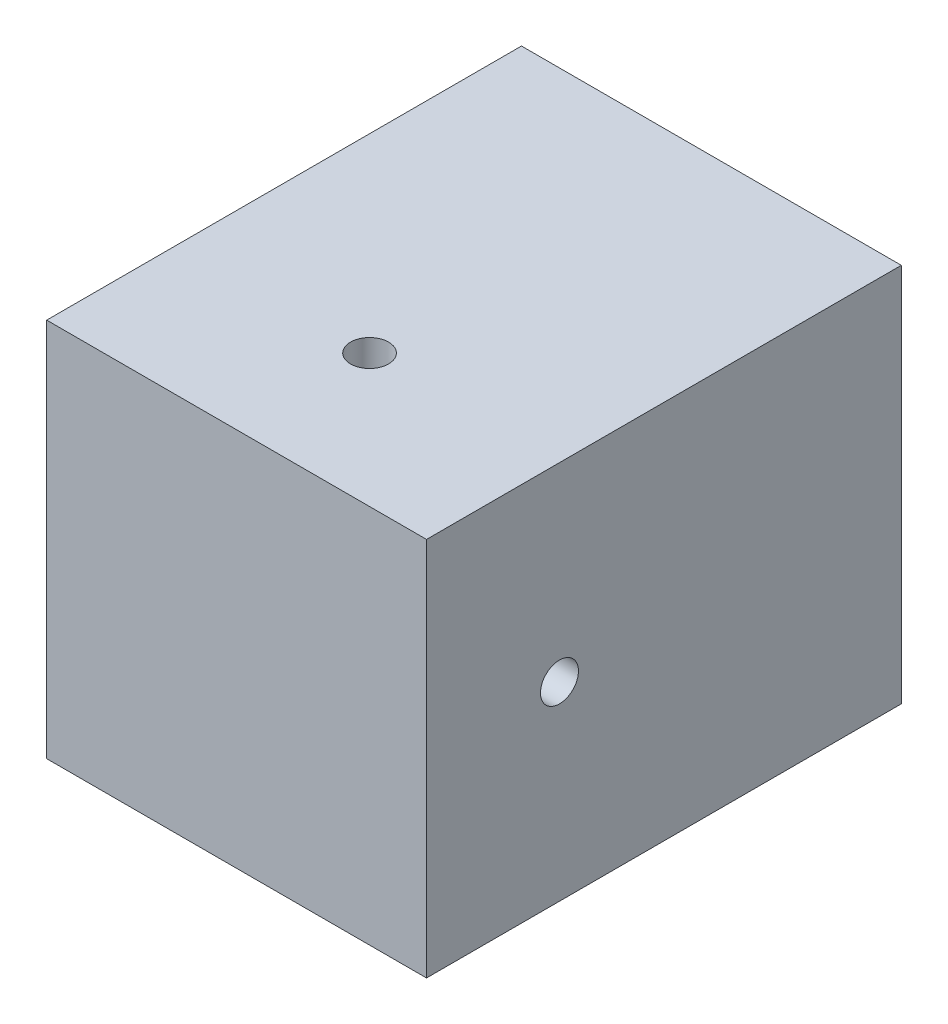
ISO-10303-21;
HEADER;
FILE_DESCRIPTION(('STEP AP214'),'2;1');
FILE_NAME('part.step','',(''),(''),'','','');
FILE_SCHEMA(('AUTOMOTIVE_DESIGN { 1 0 10303 214 1 1 1 1 }'));
ENDSEC;
DATA;
#1=APPLICATION_CONTEXT('core data for automotive mechanical design processes');
#2=APPLICATION_PROTOCOL_DEFINITION('international standard','automotive_design',2000,#1);
#3=PRODUCT_CONTEXT('',#1,'mechanical');
#4=PRODUCT('Part','Part','',(#3));
#5=PRODUCT_RELATED_PRODUCT_CATEGORY('part','',(#4));
#6=PRODUCT_DEFINITION_FORMATION('','',#4);
#7=PRODUCT_DEFINITION_CONTEXT('part definition',#1,'design');
#8=PRODUCT_DEFINITION('design','',#6,#7);
#9=PRODUCT_DEFINITION_SHAPE('','',#8);
#10=(LENGTH_UNIT() NAMED_UNIT(*) SI_UNIT(.MILLI.,.METRE.));
#11=(NAMED_UNIT(*) PLANE_ANGLE_UNIT() SI_UNIT($,.RADIAN.));
#12=(NAMED_UNIT(*) SI_UNIT($,.STERADIAN.) SOLID_ANGLE_UNIT());
#13=UNCERTAINTY_MEASURE_WITH_UNIT(LENGTH_MEASURE(1.E-05),#10,'distance_accuracy_value','');
#14=(GEOMETRIC_REPRESENTATION_CONTEXT(3) GLOBAL_UNCERTAINTY_ASSIGNED_CONTEXT((#13)) GLOBAL_UNIT_ASSIGNED_CONTEXT((#10,
#11,#12)) REPRESENTATION_CONTEXT('',''));
#15=CARTESIAN_POINT('',(0.,0.,0.));
#16=DIRECTION('',(0.,0.,1.));
#17=DIRECTION('',(1.,0.,0.));
#18=AXIS2_PLACEMENT_3D('',#15,#16,#17);
#19=CARTESIAN_POINT('',(-15.,0.,18.));
#20=DIRECTION('',(1.,0.,0.));
#21=DIRECTION('',(0.,1.,0.));
#22=AXIS2_PLACEMENT_3D('',#19,#20,#21);
#23=CYLINDRICAL_SURFACE('',#22,1.);
#24=CARTESIAN_POINT('',(10.,0.,18.));
#25=DIRECTION('',(1.,0.,0.));
#26=DIRECTION('',(0.,1.,0.));
#27=AXIS2_PLACEMENT_3D('',#24,#25,#26);
#28=CIRCLE('',#27,1.);
#29=CARTESIAN_POINT('',(10.,1.,18.));
#30=VERTEX_POINT('',#29);
#31=EDGE_CURVE('E107',#30,#30,#28,.T.);
#32=ORIENTED_EDGE('',*,*,#31,.T.);
#33=EDGE_LOOP('',(#32));
#34=FACE_BOUND('',#33,.T.);
#35=CARTESIAN_POINT('',(0.,0.,18.));
#36=DIRECTION('',(0.707106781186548,-0.707106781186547,0.));
#37=DIRECTION('',(0.707106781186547,0.707106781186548,0.));
#38=AXIS2_PLACEMENT_3D('',#35,#36,#37);
#39=ELLIPSE('',#38,1.4142135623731,1.);
#40=CARTESIAN_POINT('',(0.,0.,19.));
#41=VERTEX_POINT('',#40);
#42=CARTESIAN_POINT('',(0.,0.,17.));
#43=VERTEX_POINT('',#42);
#44=EDGE_CURVE('E46',#41,#43,#39,.F.);
#45=ORIENTED_EDGE('',*,*,#44,.T.);
#46=CARTESIAN_POINT('',(0.,0.,18.));
#47=DIRECTION('',(0.707106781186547,0.707106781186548,0.));
#48=DIRECTION('',(0.707106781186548,-0.707106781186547,0.));
#49=AXIS2_PLACEMENT_3D('',#46,#47,#48);
#50=ELLIPSE('',#49,1.4142135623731,1.);
#51=EDGE_CURVE('E11',#43,#41,#50,.F.);
#52=ORIENTED_EDGE('',*,*,#51,.T.);
#53=EDGE_LOOP('',(#45,#52));
#54=FACE_BOUND('',#53,.T.);
#55=ADVANCED_FACE('F33',(#34,#54),#23,.F.);
#56=CARTESIAN_POINT('',(10.,10.,25.));
#57=DIRECTION('',(-1.,0.,0.));
#58=DIRECTION('',(0.,-1.,0.));
#59=AXIS2_PLACEMENT_3D('',#56,#57,#58);
#60=PLANE('',#59);
#61=ORIENTED_EDGE('',*,*,#31,.F.);
#62=EDGE_LOOP('',(#61));
#63=FACE_BOUND('',#62,.T.);
#64=DIRECTION('',(0.,1.,0.));
#65=VECTOR('',#64,1.);
#66=CARTESIAN_POINT('',(10.,10.,0.));
#67=LINE('',#66,#65);
#68=CARTESIAN_POINT('',(10.,-9.99999999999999,0.));
#69=VERTEX_POINT('',#68);
#70=CARTESIAN_POINT('',(10.,10.,0.));
#71=VERTEX_POINT('',#70);
#72=EDGE_CURVE('E106',#69,#71,#67,.T.);
#73=ORIENTED_EDGE('',*,*,#72,.T.);
#74=DIRECTION('',(0.,0.,-1.));
#75=VECTOR('',#74,1.);
#76=CARTESIAN_POINT('',(10.,10.,25.));
#77=LINE('',#76,#75);
#78=CARTESIAN_POINT('',(10.,10.,25.));
#79=VERTEX_POINT('',#78);
#80=EDGE_CURVE('E98',#79,#71,#77,.T.);
#81=ORIENTED_EDGE('',*,*,#80,.F.);
#82=DIRECTION('',(0.,1.,0.));
#83=VECTOR('',#82,1.);
#84=CARTESIAN_POINT('',(10.,10.,25.));
#85=LINE('',#84,#83);
#86=CARTESIAN_POINT('',(10.,-9.99999999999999,25.));
#87=VERTEX_POINT('',#86);
#88=EDGE_CURVE('E117',#87,#79,#85,.T.);
#89=ORIENTED_EDGE('',*,*,#88,.F.);
#90=DIRECTION('',(0.,0.,-1.));
#91=VECTOR('',#90,1.);
#92=CARTESIAN_POINT('',(10.,-9.99999999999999,25.));
#93=LINE('',#92,#91);
#94=EDGE_CURVE('E114',#87,#69,#93,.T.);
#95=ORIENTED_EDGE('',*,*,#94,.T.);
#96=EDGE_LOOP('',(#73,#81,#89,#95));
#97=FACE_BOUND('',#96,.T.);
#98=ADVANCED_FACE('F35',(#63,#97),#60,.F.);
#99=CARTESIAN_POINT('',(-10.,10.,25.));
#100=DIRECTION('',(0.,-1.,0.));
#101=DIRECTION('',(0.,0.,-1.));
#102=AXIS2_PLACEMENT_3D('',#99,#100,#101);
#103=PLANE('',#102);
#104=CARTESIAN_POINT('',(0.,10.,18.));
#105=DIRECTION('',(0.,1.,0.));
#106=DIRECTION('',(0.,0.,1.));
#107=AXIS2_PLACEMENT_3D('',#104,#105,#106);
#108=CIRCLE('',#107,1.);
#109=CARTESIAN_POINT('',(0.,10.,19.));
#110=VERTEX_POINT('',#109);
#111=EDGE_CURVE('E134',#110,#110,#108,.T.);
#112=ORIENTED_EDGE('',*,*,#111,.F.);
#113=EDGE_LOOP('',(#112));
#114=FACE_BOUND('',#113,.T.);
#115=DIRECTION('',(-1.,0.,0.));
#116=VECTOR('',#115,1.);
#117=CARTESIAN_POINT('',(-10.,10.,0.));
#118=LINE('',#117,#116);
#119=CARTESIAN_POINT('',(-10.,10.,0.));
#120=VERTEX_POINT('',#119);
#121=EDGE_CURVE('E120',#71,#120,#118,.T.);
#122=ORIENTED_EDGE('',*,*,#121,.T.);
#123=DIRECTION('',(0.,0.,-1.));
#124=VECTOR('',#123,1.);
#125=CARTESIAN_POINT('',(-10.,10.,25.));
#126=LINE('',#125,#124);
#127=CARTESIAN_POINT('',(-10.,10.,25.));
#128=VERTEX_POINT('',#127);
#129=EDGE_CURVE('E109',#128,#120,#126,.T.);
#130=ORIENTED_EDGE('',*,*,#129,.F.);
#131=DIRECTION('',(-1.,0.,0.));
#132=VECTOR('',#131,1.);
#133=CARTESIAN_POINT('',(-10.,10.,25.));
#134=LINE('',#133,#132);
#135=EDGE_CURVE('E84',#79,#128,#134,.T.);
#136=ORIENTED_EDGE('',*,*,#135,.F.);
#137=ORIENTED_EDGE('',*,*,#80,.T.);
#138=EDGE_LOOP('',(#122,#130,#136,#137));
#139=FACE_BOUND('',#138,.T.);
#140=ADVANCED_FACE('F139',(#114,#139),#103,.F.);
#141=CARTESIAN_POINT('',(-10.,10.,25.));
#142=DIRECTION('',(1.,0.,0.));
#143=DIRECTION('',(0.,1.,0.));
#144=AXIS2_PLACEMENT_3D('',#141,#142,#143);
#145=PLANE('',#144);
#146=CARTESIAN_POINT('',(-10.,0.,18.));
#147=DIRECTION('',(1.,0.,0.));
#148=DIRECTION('',(0.,1.,0.));
#149=AXIS2_PLACEMENT_3D('',#146,#147,#148);
#150=CIRCLE('',#149,1.);
#151=CARTESIAN_POINT('',(-10.,1.,18.));
#152=VERTEX_POINT('',#151);
#153=EDGE_CURVE('E103',#152,#152,#150,.T.);
#154=ORIENTED_EDGE('',*,*,#153,.T.);
#155=EDGE_LOOP('',(#154));
#156=FACE_BOUND('',#155,.T.);
#157=DIRECTION('',(0.,-1.,0.));
#158=VECTOR('',#157,1.);
#159=CARTESIAN_POINT('',(-10.,10.,0.));
#160=LINE('',#159,#158);
#161=CARTESIAN_POINT('',(-10.,-9.99999999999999,0.));
#162=VERTEX_POINT('',#161);
#163=EDGE_CURVE('E118',#120,#162,#160,.T.);
#164=ORIENTED_EDGE('',*,*,#163,.T.);
#165=DIRECTION('',(0.,0.,-1.));
#166=VECTOR('',#165,1.);
#167=CARTESIAN_POINT('',(-10.,-9.99999999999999,25.));
#168=LINE('',#167,#166);
#169=CARTESIAN_POINT('',(-10.,-9.99999999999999,25.));
#170=VERTEX_POINT('',#169);
#171=EDGE_CURVE('E112',#170,#162,#168,.T.);
#172=ORIENTED_EDGE('',*,*,#171,.F.);
#173=DIRECTION('',(0.,-1.,0.));
#174=VECTOR('',#173,1.);
#175=CARTESIAN_POINT('',(-10.,10.,25.));
#176=LINE('',#175,#174);
#177=EDGE_CURVE('E125',#128,#170,#176,.T.);
#178=ORIENTED_EDGE('',*,*,#177,.F.);
#179=ORIENTED_EDGE('',*,*,#129,.T.);
#180=EDGE_LOOP('',(#164,#172,#178,#179));
#181=FACE_BOUND('',#180,.T.);
#182=ADVANCED_FACE('F141',(#156,#181),#145,.F.);
#183=CARTESIAN_POINT('',(-10.,-9.99999999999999,25.));
#184=DIRECTION('',(0.,1.,0.));
#185=DIRECTION('',(0.,0.,1.));
#186=AXIS2_PLACEMENT_3D('',#183,#184,#185);
#187=PLANE('',#186);
#188=CARTESIAN_POINT('',(0.,-9.99999999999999,18.));
#189=DIRECTION('',(0.,1.,0.));
#190=DIRECTION('',(0.,0.,1.));
#191=AXIS2_PLACEMENT_3D('',#188,#189,#190);
#192=CIRCLE('',#191,1.);
#193=CARTESIAN_POINT('',(0.,-9.99999999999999,19.));
#194=VERTEX_POINT('',#193);
#195=EDGE_CURVE('E131',#194,#194,#192,.T.);
#196=ORIENTED_EDGE('',*,*,#195,.T.);
#197=EDGE_LOOP('',(#196));
#198=FACE_BOUND('',#197,.T.);
#199=DIRECTION('',(1.,0.,0.));
#200=VECTOR('',#199,1.);
#201=CARTESIAN_POINT('',(-10.,-9.99999999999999,0.));
#202=LINE('',#201,#200);
#203=EDGE_CURVE('E76',#162,#69,#202,.T.);
#204=ORIENTED_EDGE('',*,*,#203,.T.);
#205=ORIENTED_EDGE('',*,*,#94,.F.);
#206=DIRECTION('',(1.,0.,0.));
#207=VECTOR('',#206,1.);
#208=CARTESIAN_POINT('',(-10.,-9.99999999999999,25.));
#209=LINE('',#208,#207);
#210=EDGE_CURVE('E55',#170,#87,#209,.T.);
#211=ORIENTED_EDGE('',*,*,#210,.F.);
#212=ORIENTED_EDGE('',*,*,#171,.T.);
#213=EDGE_LOOP('',(#204,#205,#211,#212));
#214=FACE_BOUND('',#213,.T.);
#215=ADVANCED_FACE('F152',(#198,#214),#187,.F.);
#216=CARTESIAN_POINT('',(0.,0.,25.));
#217=DIRECTION('',(0.,0.,1.));
#218=DIRECTION('',(1.,0.,0.));
#219=AXIS2_PLACEMENT_3D('',#216,#217,#218);
#220=PLANE('',#219);
#221=ORIENTED_EDGE('',*,*,#88,.T.);
#222=ORIENTED_EDGE('',*,*,#135,.T.);
#223=ORIENTED_EDGE('',*,*,#177,.T.);
#224=ORIENTED_EDGE('',*,*,#210,.T.);
#225=EDGE_LOOP('',(#221,#222,#223,#224));
#226=FACE_BOUND('',#225,.T.);
#227=ADVANCED_FACE('F154',(#226),#220,.T.);
#228=CARTESIAN_POINT('',(0.,0.,0.));
#229=DIRECTION('',(0.,0.,1.));
#230=DIRECTION('',(1.,0.,0.));
#231=AXIS2_PLACEMENT_3D('',#228,#229,#230);
#232=PLANE('',#231);
#233=ORIENTED_EDGE('',*,*,#72,.F.);
#234=ORIENTED_EDGE('',*,*,#203,.F.);
#235=ORIENTED_EDGE('',*,*,#163,.F.);
#236=ORIENTED_EDGE('',*,*,#121,.F.);
#237=EDGE_LOOP('',(#233,#234,#235,#236));
#238=FACE_BOUND('',#237,.T.);
#239=ADVANCED_FACE('F149',(#238),#232,.F.);
#240=CARTESIAN_POINT('',(0.,0.,18.));
#241=DIRECTION('',(0.707106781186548,-0.707106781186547,0.));
#242=DIRECTION('',(0.707106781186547,0.707106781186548,0.));
#243=AXIS2_PLACEMENT_3D('',#240,#241,#242);
#244=ELLIPSE('',#243,1.4142135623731,1.);
#245=EDGE_CURVE('E90',#41,#43,#244,.T.);
#246=ORIENTED_EDGE('',*,*,#245,.T.);
#247=CARTESIAN_POINT('',(0.,0.,18.));
#248=DIRECTION('',(0.707106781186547,0.707106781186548,0.));
#249=DIRECTION('',(0.707106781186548,-0.707106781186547,0.));
#250=AXIS2_PLACEMENT_3D('',#247,#248,#249);
#251=ELLIPSE('',#250,1.4142135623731,1.);
#252=EDGE_CURVE('E41',#43,#41,#251,.T.);
#253=ORIENTED_EDGE('',*,*,#252,.T.);
#254=EDGE_LOOP('',(#246,#253));
#255=FACE_BOUND('',#254,.T.);
#256=ORIENTED_EDGE('',*,*,#153,.F.);
#257=EDGE_LOOP('',(#256));
#258=FACE_BOUND('',#257,.T.);
#259=ADVANCED_FACE('F100',(#255,#258),#23,.F.);
#260=CARTESIAN_POINT('',(0.,-15.,18.));
#261=DIRECTION('',(0.,1.,0.));
#262=DIRECTION('',(0.,0.,1.));
#263=AXIS2_PLACEMENT_3D('',#260,#261,#262);
#264=CYLINDRICAL_SURFACE('',#263,1.);
#265=ORIENTED_EDGE('',*,*,#111,.T.);
#266=EDGE_LOOP('',(#265));
#267=FACE_BOUND('',#266,.T.);
#268=ORIENTED_EDGE('',*,*,#44,.F.);
#269=ORIENTED_EDGE('',*,*,#252,.F.);
#270=EDGE_LOOP('',(#268,#269));
#271=FACE_BOUND('',#270,.T.);
#272=ADVANCED_FACE('F97',(#267,#271),#264,.F.);
#273=ORIENTED_EDGE('',*,*,#245,.F.);
#274=ORIENTED_EDGE('',*,*,#51,.F.);
#275=EDGE_LOOP('',(#273,#274));
#276=FACE_BOUND('',#275,.T.);
#277=ORIENTED_EDGE('',*,*,#195,.F.);
#278=EDGE_LOOP('',(#277));
#279=FACE_BOUND('',#278,.T.);
#280=ADVANCED_FACE('F91',(#276,#279),#264,.F.);
#281=CLOSED_SHELL('',(#55,#98,#140,#182,#215,#227,#239,#259,#272,#280));
#282=MANIFOLD_SOLID_BREP('B2',#281);
#283=ADVANCED_BREP_SHAPE_REPRESENTATION('',(#18,#282),#14);
#284=SHAPE_DEFINITION_REPRESENTATION(#9,#283);
ENDSEC;
END-ISO-10303-21;
